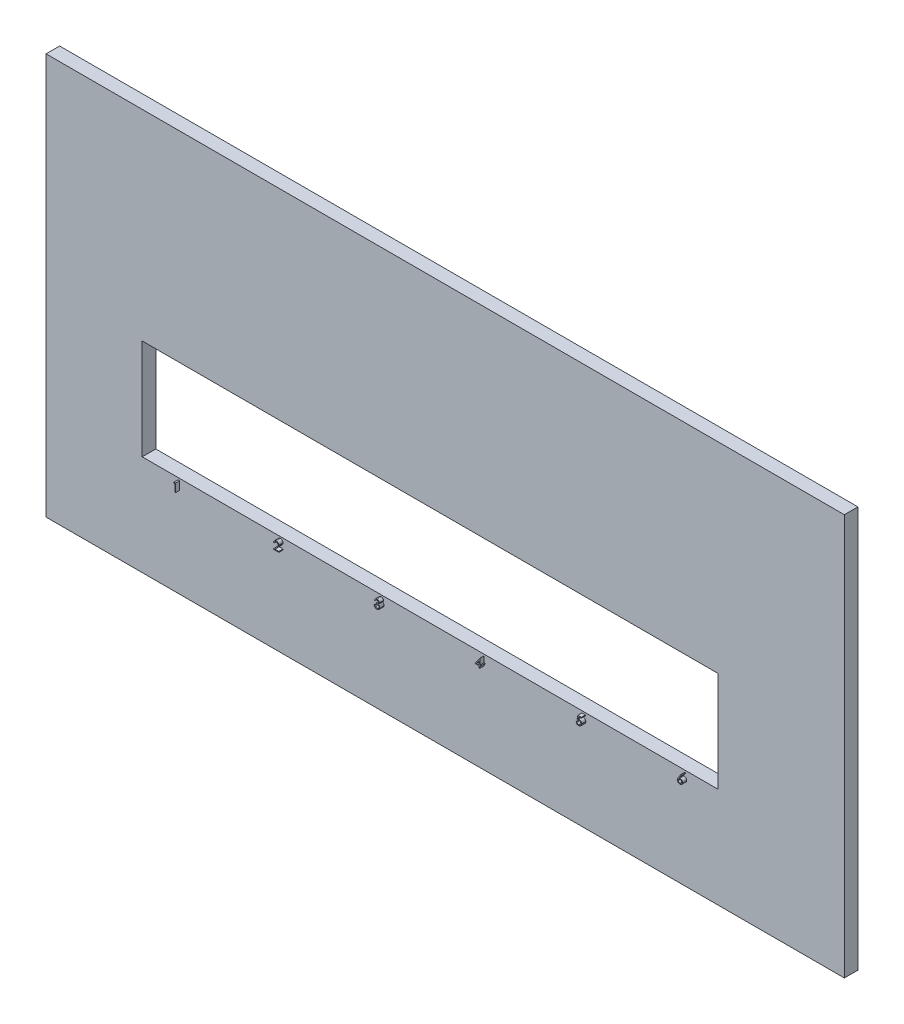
from build123d import *

# Parameters (mm, degrees)
SKETCH1_W           = 4851.4
SKETCH1_H           = 2438.4
BOSS_EXTRUDE1_DEPTH = 82.55
SKETCH2_W           = 3498.85
SKETCH2_H           = 609.6
CUT_EXTRUDE1_DEPTH  = 5431.349070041
BOSS_EXTRUDE2_DEPTH = 25.4


with BuildPart() as part:
    # Sketch1 → Boss-Extrude1 (new body)
    with BuildSketch(Plane.XY):
        with Locations((2425.7, 1219.2)):
            Rectangle(SKETCH1_W, SKETCH1_H)
    extrude(amount=BOSS_EXTRUDE1_DEPTH)

    # Sketch2 → Cut-Extrude1 (cut, through all)
    with BuildSketch(Plane.XY.offset(82.55)):
        with Locations((2333.625, 914.4)):
            Rectangle(SKETCH2_W, SKETCH2_H)
    extrude(amount=-CUT_EXTRUDE1_DEPTH, mode=Mode.SUBTRACT)

    # Sketch3 → Boss-Extrude2 (add)
    # profile 1 of 6: a face of its own
    with BuildSketch(Plane.XY.offset(82.55)):
        Polygon((802.851010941, 598.135093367), (812.243719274, 598.135093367), (812.243719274, 547.335093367), (807.684744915, 547.335093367), (807.684744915, 592.924836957), (799.8693603, 592.924836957), align=None)
    # profile 2 of 6: a face of its own
    with BuildSketch(Plane.XY.offset(82.55)):
        with BuildLine():
            Line((1412.074488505, 582.504324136), (1407.515514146, 582.504324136))
            add(Edge.make_bspline(
                [(1407.515514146, 582.504324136), (1407.54522711, 583.109147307), (1407.60358258, 584.297003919), (1407.87686175, 586.028905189), (1408.267889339, 587.684329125), (1408.820759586, 589.249983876), (1409.507376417, 590.739712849), (1410.330772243, 592.147598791), (1411.306042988, 593.468270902), (1412.412129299, 594.689486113), (1413.613456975, 595.809808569), (1414.909668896, 596.777261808), (1416.271762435, 597.594672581), (1417.69560514, 598.278023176), (1419.19726132, 598.790955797), (1420.763103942, 599.171544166), (1422.40001255, 599.400526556), (1423.515290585, 599.425139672), (1424.082501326, 599.437657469)],
                knots=[0, 0, 0, 0, 1.10065271, 2.161652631, 3.183658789, 4.190468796, 5.17591951, 6.163126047, 7.15150782, 8.156236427, 9.156009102, 10.134482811, 11.092018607, 12.041330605, 13.001268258, 13.972401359, 14.968799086, 16, 16, 16, 16], degree=3))
            add(Edge.make_bspline(
                [(1424.082501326, 599.437657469), (1424.639531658, 599.424617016), (1425.734076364, 599.398992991), (1427.331547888, 599.17894148), (1428.852315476, 598.834291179), (1430.293406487, 598.350741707), (1431.643323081, 597.700727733), (1432.912206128, 596.919894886), (1434.115161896, 596.016818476), (1435.19802607, 594.953591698), (1436.192371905, 593.818539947), (1437.050198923, 592.60677266), (1437.784812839, 591.35521617), (1438.397136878, 590.054326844), (1438.847894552, 588.691855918), (1439.1901154, 587.287639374), (1439.38355329, 585.827142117), (1439.413241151, 584.83862411), (1439.428334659, 584.336054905)],
                knots=[0, 0, 0, 0, 1.111607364, 2.184268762, 3.212621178, 4.221274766, 5.211760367, 6.196651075, 7.1921475, 8.207485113, 9.220403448, 10.201281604, 11.166441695, 12.114753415, 13.065576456, 14.026450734, 14.996634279, 16, 16, 16, 16], degree=3))
            add(Edge.make_bspline(
                [(1439.428334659, 584.336054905), (1439.403758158, 583.628514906), (1439.355036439, 582.225851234), (1438.938267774, 580.16460694), (1438.287352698, 578.167536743), (1437.503619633, 576.560263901), (1436.712991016, 575.265103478), (1436.000520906, 574.198757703), (1435.166460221, 573.050598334), (1434.19866945, 571.824470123), (1433.117168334, 570.510768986), (1431.912160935, 569.110288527), (1430.575054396, 567.637498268), (1429.636582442, 566.631576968), (1429.150289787, 566.110333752)],
                knots=[0, 0, 0, 0, 1.184426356, 2.348067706, 3.509069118, 4.696110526, 5.333549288, 6.050745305, 6.844228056, 7.710549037, 8.667450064, 9.695053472, 10.805634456, 12, 12, 12, 12], degree=3))
            Line((1429.150289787, 566.110333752), (1416.440113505, 552.545349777))
            Line((1416.440113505, 552.545349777), (1440.07961671, 552.545349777))
            Line((1440.07961671, 552.545349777), (1440.07961671, 547.335093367))
            Line((1440.07961671, 547.335093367), (1405.561667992, 547.335093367))
            Line((1405.561667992, 547.335093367), (1425.262950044, 568.359292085))
            add(Edge.make_bspline(
                [(1425.262950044, 568.359292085), (1425.742616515, 568.860010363), (1426.66395764, 569.8217877), (1427.967087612, 571.225942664), (1429.137504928, 572.528593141), (1430.182785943, 573.727277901), (1431.080255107, 574.839530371), (1431.876686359, 575.829327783), (1432.514815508, 576.740163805), (1433.207370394, 577.795941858), (1433.878133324, 579.084989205), (1434.454529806, 580.66027818), (1434.805991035, 582.281919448), (1434.848152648, 583.377777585), (1434.8693603, 583.929003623)],
                knots=[0, 0, 0, 0, 1.329631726, 2.553950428, 3.673215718, 4.687767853, 5.603093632, 6.413772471, 7.123043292, 7.734684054, 8.834405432, 9.900288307, 10.943827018, 12, 12, 12, 12], degree=3))
            add(Edge.make_bspline(
                [(1434.8693603, 583.929003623), (1434.860132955, 584.275625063), (1434.841947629, 584.95874936), (1434.681453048, 585.960318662), (1434.438911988, 586.926459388), (1434.091363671, 587.860143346), (1433.632614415, 588.751983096), (1433.074200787, 589.603064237), (1432.429910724, 590.425864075), (1431.684583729, 591.197346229), (1430.865810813, 591.903919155), (1430.000842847, 592.529834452), (1429.08571562, 593.052916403), (1428.124287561, 593.481719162), (1427.119239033, 593.818093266), (1426.068626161, 594.051172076), (1424.975351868, 594.197512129), (1424.228831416, 594.217312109), (1423.848446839, 594.227401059)],
                knots=[0, 0, 0, 0, 0.991446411, 1.95395049, 2.89581595, 3.838931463, 4.798493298, 5.75982156, 6.748411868, 7.785213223, 8.824556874, 9.840280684, 10.836137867, 11.835679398, 12.848801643, 13.863922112, 14.911575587, 16, 16, 16, 16], degree=3))
            add(Edge.make_bspline(
                [(1423.848446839, 594.227401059), (1423.451178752, 594.217022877), (1422.671009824, 594.19664184), (1421.525556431, 594.054072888), (1420.432837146, 593.808116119), (1419.39010324, 593.471723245), (1418.395590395, 593.044153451), (1417.454135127, 592.511598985), (1416.567850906, 591.876112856), (1415.735071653, 591.155615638), (1414.967788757, 590.353445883), (1414.29364553, 589.459221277), (1413.704597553, 588.489269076), (1413.190657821, 587.446206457), (1412.77328952, 586.320568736), (1412.454364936, 585.116351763), (1412.202007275, 583.838784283), (1412.117700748, 582.956532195), (1412.074488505, 582.504324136)],
                knots=[0, 0, 0, 0, 1.031018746, 2.02475058, 2.990194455, 3.934040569, 4.864654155, 5.795059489, 6.735614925, 7.690564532, 8.649604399, 9.611025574, 10.590972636, 11.591080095, 12.624614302, 13.701020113, 14.821632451, 16, 16, 16, 16], degree=3))
        make_face()
    # profile 3 of 6: a face of its own
    with BuildSketch(Plane.XY.offset(82.55)):
        with BuildLine():
            Line((2025.582180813, 586.412016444), (2021.023206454, 586.412016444))
            add(Edge.make_bspline(
                [(2021.023206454, 586.412016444), (2021.146716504, 586.923390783), (2021.388168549, 587.923085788), (2021.891779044, 589.351396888), (2022.440408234, 590.703018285), (2023.099198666, 591.952641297), (2023.81778287, 593.125379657), (2024.641072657, 594.194634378), (2025.53108463, 595.187599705), (2026.515515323, 596.068808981), (2027.54789704, 596.866771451), (2028.642776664, 597.547129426), (2029.778126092, 598.132405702), (2030.961811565, 598.614573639), (2032.197357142, 598.97780124), (2033.473592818, 599.241334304), (2034.793863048, 599.412473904), (2035.69008522, 599.429176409), (2036.145161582, 599.437657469)],
                knots=[0, 0, 0, 0, 1.162005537, 2.271625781, 3.343758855, 4.383309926, 5.390229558, 6.379919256, 7.361854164, 8.333198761, 9.295911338, 10.242430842, 11.177959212, 12.116337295, 13.062827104, 14.020064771, 14.994644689, 16, 16, 16, 16], degree=3))
            add(Edge.make_bspline(
                [(2036.145161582, 599.437657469), (2036.808213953, 599.417638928), (2038.119855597, 599.378038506), (2040.046816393, 599.016423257), (2041.905034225, 598.444195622), (2043.674169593, 597.653548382), (2045.317454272, 596.678372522), (2046.779568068, 595.517741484), (2048.040692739, 594.194048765), (2049.098702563, 592.731987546), (2049.927105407, 591.169444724), (2050.537959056, 589.561259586), (2050.909839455, 587.911246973), (2050.958034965, 586.797169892), (2050.982180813, 586.239019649)],
                knots=[0, 0, 0, 0, 1.083050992, 2.142477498, 3.193116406, 4.255571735, 5.30263384, 6.308962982, 7.297363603, 8.282367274, 9.249857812, 10.179914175, 11.08814088, 12, 12, 12, 12], degree=3))
            add(Edge.make_bspline(
                [(2050.982180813, 586.239019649), (2050.96529212, 585.701892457), (2050.932243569, 584.650817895), (2050.651628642, 583.11634588), (2050.179388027, 581.670119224), (2049.525232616, 580.306049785), (2048.678446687, 579.032786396), (2047.652682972, 577.847464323), (2046.440701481, 576.744826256), (2045.522252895, 576.113172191), (2045.049408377, 575.787977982)],
                knots=[0, 0, 0, 0, 1.024540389, 2.004866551, 2.965041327, 3.920577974, 4.882998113, 5.874504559, 6.905732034, 8, 8, 8, 8], degree=3))
            add(Edge.make_bspline(
                [(2045.049408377, 575.787977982), (2045.589800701, 575.527037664), (2046.66047419, 575.010039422), (2048.119893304, 573.996132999), (2049.444726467, 572.825463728), (2050.183557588, 571.91189608), (2050.554776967, 571.452881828)],
                knots=[0, 0, 0, 0, 1.015518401, 2.012035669, 3.001164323, 4, 4, 4, 4], degree=3))
            add(Edge.make_bspline(
                [(2050.554776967, 571.452881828), (2050.799217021, 571.118215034), (2051.284094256, 570.454361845), (2051.882598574, 569.387033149), (2052.425565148, 568.30787439), (2052.84865976, 567.187960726), (2053.176303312, 566.040272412), (2053.410506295, 564.862838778), (2053.555999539, 563.654698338), (2053.576835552, 562.837362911), (2053.587309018, 562.426519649)],
                knots=[0, 0, 0, 0, 1.025084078, 2.033381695, 3.024893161, 4.013698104, 4.991890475, 5.976764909, 6.982997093, 8, 8, 8, 8], degree=3))
            add(Edge.make_bspline(
                [(2053.587309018, 562.426519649), (2053.561262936, 561.715178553), (2053.509293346, 560.295843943), (2053.044777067, 558.198896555), (2052.324676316, 556.149109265), (2051.302044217, 554.188594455), (2050.05573866, 552.354273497), (2048.57299807, 550.71305164), (2046.870669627, 549.302283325), (2044.972119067, 548.123574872), (2042.915196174, 547.181337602), (2040.715184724, 546.527361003), (2038.403783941, 546.101424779), (2036.818718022, 546.055750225), (2036.012869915, 546.032529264)],
                knots=[0, 0, 0, 0, 0.955779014, 1.907060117, 2.875433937, 3.871313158, 4.872415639, 5.851225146, 6.836215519, 7.83643374, 8.849228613, 9.86973379, 10.916971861, 12, 12, 12, 12], degree=3))
            add(Edge.make_bspline(
                [(2036.012869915, 546.032529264), (2035.4697555, 546.04513076), (2034.401087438, 546.0699263), (2032.830010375, 546.239432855), (2031.33036971, 546.549022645), (2029.900137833, 546.96563062), (2028.538044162, 547.493830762), (2027.24824515, 548.151599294), (2026.022805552, 548.925377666), (2024.873289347, 549.824299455), (2023.799833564, 550.829868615), (2022.830965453, 551.959936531), (2021.950531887, 553.193613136), (2021.182107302, 554.545227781), (2020.490690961, 555.997313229), (2019.922007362, 557.568462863), (2019.421473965, 559.244630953), (2019.188759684, 560.412707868), (2019.0693603, 561.012016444)],
                knots=[0, 0, 0, 0, 1.048658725, 2.063410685, 3.046034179, 4.001477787, 4.936774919, 5.862367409, 6.792675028, 7.730719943, 8.675894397, 9.627829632, 10.600096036, 11.597688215, 12.626045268, 13.701542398, 14.82072376, 16, 16, 16, 16], degree=3))
            Line((2019.0693603, 561.012016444), (2023.628334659, 561.012016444))
            add(Edge.make_bspline(
                [(2023.628334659, 561.012016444), (2023.747109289, 560.620870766), (2023.978136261, 559.860058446), (2024.371390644, 558.765096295), (2024.819421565, 557.761316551), (2025.30005573, 556.841355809), (2025.804840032, 555.996154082), (2026.369662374, 555.248060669), (2026.952688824, 554.564217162), (2027.39217201, 554.17894108), (2027.607260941, 553.990381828)],
                knots=[0, 0, 0, 0, 1.198163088, 2.33053128, 3.407730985, 4.417276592, 5.372219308, 6.28897303, 7.162600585, 8, 8, 8, 8], degree=3))
            add(Edge.make_bspline(
                [(2027.607260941, 553.990381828), (2027.891691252, 553.771095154), (2028.459673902, 553.333198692), (2029.385224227, 552.774375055), (2030.358623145, 552.290163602), (2031.400961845, 551.920285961), (2032.489747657, 551.607101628), (2033.642579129, 551.402152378), (2034.84928548, 551.261535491), (2035.673229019, 551.249126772), (2036.094280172, 551.242785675)],
                knots=[0, 0, 0, 0, 0.946170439, 1.889420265, 2.845303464, 3.807233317, 4.801018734, 5.828864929, 6.890507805, 8, 8, 8, 8], degree=3))
            add(Edge.make_bspline(
                [(2036.094280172, 551.242785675), (2036.569673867, 551.251725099), (2037.4992652, 551.269205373), (2038.85569573, 551.429961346), (2040.146123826, 551.664082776), (2041.356222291, 552.025676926), (2042.501842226, 552.472438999), (2043.566924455, 553.033392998), (2044.565450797, 553.691539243), (2045.484631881, 554.439593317), (2046.311155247, 555.258511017), (2047.038894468, 556.115043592), (2047.657560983, 557.005579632), (2048.156614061, 557.935047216), (2048.550684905, 558.899597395), (2048.818955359, 559.901936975), (2049.005485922, 560.93386301), (2049.02067675, 561.635323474), (2049.028334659, 561.988939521)],
                knots=[0, 0, 0, 0, 1.217147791, 2.380027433, 3.494444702, 4.572153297, 5.609568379, 6.639424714, 7.649109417, 8.668170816, 9.669597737, 10.625200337, 11.543417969, 12.441394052, 13.322311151, 14.205496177, 15.095365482, 16, 16, 16, 16], degree=3))
            add(Edge.make_bspline(
                [(2049.028334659, 561.988939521), (2049.006123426, 562.462269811), (2048.961811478, 563.406575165), (2048.623504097, 564.795847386), (2048.067042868, 566.134404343), (2047.288024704, 567.399408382), (2046.339723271, 568.571812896), (2045.231341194, 569.617878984), (2043.953674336, 570.481044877), (2042.777728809, 571.077417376), (2041.736108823, 571.484355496), (2040.844708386, 571.755409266), (2039.8467554, 571.984933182), (2038.754318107, 572.198471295), (2037.559165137, 572.380209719), (2036.262597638, 572.531765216), (2034.864352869, 572.653032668), (2033.896378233, 572.707186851), (2033.397565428, 572.735093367)],
                knots=[0, 0, 0, 0, 1.07054697, 2.135767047, 3.216561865, 4.33974944, 5.486079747, 6.621378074, 7.775625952, 8.963672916, 9.598146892, 10.304877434, 11.070270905, 11.915000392, 12.823868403, 13.805723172, 14.86925407, 16, 16, 16, 16], degree=3))
            Line((2033.397565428, 572.735093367), (2033.397565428, 577.945349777))
            add(Edge.make_bspline(
                [(2033.397565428, 577.945349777), (2034.026050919, 577.956014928), (2035.257099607, 577.976905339), (2037.055336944, 578.229570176), (2038.774892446, 578.579083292), (2040.37765773, 579.114445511), (2041.838501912, 579.73624182), (2043.105883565, 580.459811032), (2044.162046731, 581.264116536), (2045.001858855, 582.161572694), (2045.633654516, 583.12408824), (2046.095597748, 584.127267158), (2046.368471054, 585.179902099), (2046.404897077, 585.898281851), (2046.423206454, 586.259372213)],
                knots=[0, 0, 0, 0, 1.321986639, 2.589447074, 3.816329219, 5.01088745, 6.139805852, 7.153945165, 8.075214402, 8.924034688, 9.728124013, 10.488707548, 11.240355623, 12, 12, 12, 12], degree=3))
            add(Edge.make_bspline(
                [(2046.423206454, 586.259372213), (2046.417191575, 586.524660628), (2046.405225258, 587.052439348), (2046.254316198, 587.823511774), (2046.027544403, 588.571011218), (2045.715781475, 589.291758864), (2045.298492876, 589.980755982), (2044.799114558, 590.643876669), (2044.204491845, 591.277334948), (2043.523112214, 591.867780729), (2042.791420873, 592.430488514), (2041.989509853, 592.908206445), (2041.141558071, 593.316711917), (2040.246626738, 593.653581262), (2039.301811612, 593.906990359), (2038.311551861, 594.088939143), (2037.273959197, 594.202697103), (2036.566072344, 594.219075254), (2036.206219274, 594.227401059)],
                knots=[0, 0, 0, 0, 0.884392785, 1.759457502, 2.611959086, 3.489218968, 4.37281399, 5.2945488, 6.255912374, 7.266815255, 8.301784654, 9.332968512, 10.37626691, 11.440494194, 12.520033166, 13.637162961, 14.798855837, 16, 16, 16, 16], degree=3))
            add(Edge.make_bspline(
                [(2036.206219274, 594.227401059), (2035.627800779, 594.207206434), (2034.498014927, 594.167761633), (2032.869295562, 593.822277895), (2031.355174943, 593.27105314), (2030.197825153, 592.613076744), (2029.343186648, 591.963556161), (2028.732469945, 591.396303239), (2028.132732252, 590.765906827), (2027.583429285, 590.033539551), (2027.027909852, 589.248798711), (2026.52216593, 588.371792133), (2026.030716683, 587.425396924), (2025.734588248, 586.756351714), (2025.582180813, 586.412016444)],
                knots=[0, 0, 0, 0, 1.472543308, 2.876219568, 4.221790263, 5.565193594, 6.249813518, 6.953379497, 7.687249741, 8.463570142, 9.283606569, 10.136032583, 11.040678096, 12, 12, 12, 12], degree=3))
        make_face()
    # profile 4 of 6: a face of its own
    with BuildSketch(Plane.XY.offset(82.55)):
        Polygon((2660.307421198, 599.437657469), (2661.233462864, 599.437657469), (2661.233462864, 564.2684267), (2667.095001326, 564.2684267), (2667.095001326, 559.05817029), (2661.233462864, 559.05817029), (2661.233462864, 547.335093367), (2656.674488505, 547.335093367), (2656.674488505, 559.05817029), (2632.577052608, 559.05817029), align=None)
        Polygon((2656.674488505, 564.2684267), (2656.674488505, 586.330606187), (2641.532180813, 564.2684267), align=None, mode=Mode.SUBTRACT)
    # profile 5 of 6: a face of its own
    with BuildSketch(Plane.XY.offset(82.55)):
        with BuildLine():
            Line((3277.997565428, 598.135093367), (3277.997565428, 592.924836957))
            Line((3277.997565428, 592.924836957), (3260.718238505, 592.924836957))
            Line((3260.718238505, 592.924836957), (3257.980818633, 579.563378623))
            add(Edge.make_bspline(
                [(3257.980818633, 579.563378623), (3258.518658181, 579.711863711), (3259.560637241, 579.999530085), (3261.098568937, 580.318928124), (3262.558592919, 580.511466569), (3263.506018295, 580.537756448), (3263.96447248, 580.550477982)],
                knots=[0, 0, 0, 0, 1.100273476, 2.13160584, 3.095893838, 4, 4, 4, 4], degree=3))
            add(Edge.make_bspline(
                [(3263.96447248, 580.550477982), (3264.531745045, 580.53819983), (3265.64714464, 580.514057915), (3267.279115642, 580.282237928), (3268.836975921, 579.917350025), (3270.317467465, 579.407600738), (3271.723329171, 578.755768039), (3273.04162635, 577.941517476), (3274.292146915, 576.990347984), (3275.452456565, 575.896768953), (3276.505095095, 574.693220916), (3277.430612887, 573.399158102), (3278.216744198, 572.027156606), (3278.84899744, 570.56410777), (3279.353867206, 569.026186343), (3279.689901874, 567.397210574), (3279.913664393, 565.692535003), (3279.9386636, 564.526971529), (3279.951411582, 563.932609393)],
                knots=[0, 0, 0, 0, 1.052922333, 2.070308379, 3.05430497, 4.020497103, 4.973039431, 5.925935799, 6.892292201, 7.88610001, 8.88166317, 9.857072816, 10.836096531, 11.812156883, 12.81219415, 13.836441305, 14.89672472, 16, 16, 16, 16], degree=3))
            add(Edge.make_bspline(
                [(3279.951411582, 563.932609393), (3279.94175849, 563.518629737), (3279.922582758, 562.696265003), (3279.825067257, 561.474972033), (3279.637314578, 560.279534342), (3279.385234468, 559.10979334), (3279.058047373, 557.967963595), (3278.661966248, 556.850776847), (3278.177246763, 555.765186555), (3277.645568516, 554.700920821), (3277.04690535, 553.682039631), (3276.382463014, 552.729191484), (3275.680472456, 551.828082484), (3274.925128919, 550.988376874), (3274.109411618, 550.2155925), (3273.243199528, 549.505143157), (3272.333404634, 548.845014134), (3271.365951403, 548.262001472), (3270.36239765, 547.725510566), (3269.308250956, 547.285386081), (3268.227507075, 546.891896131), (3267.104611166, 546.578249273), (3265.942106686, 546.332485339), (3264.738077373, 546.165562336), (3263.498837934, 546.043984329), (3262.658823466, 546.036373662), (3262.234504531, 546.032529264)],
                knots=[0, 0, 0, 0, 1.056347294, 2.098418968, 3.122841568, 4.141288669, 5.149314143, 6.15115421, 7.162517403, 8.180376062, 9.185164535, 10.17417709, 11.141909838, 12.097768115, 13.052685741, 14.0056014, 14.954263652, 15.917497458, 16.885230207, 17.854509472, 18.828990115, 19.81800267, 20.826176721, 21.857883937, 22.917946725, 24, 24, 24, 24], degree=3))
            add(Edge.make_bspline(
                [(3262.234504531, 546.032529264), (3261.728330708, 546.042556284), (3260.732493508, 546.062283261), (3259.273509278, 546.268654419), (3257.869765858, 546.564222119), (3256.532563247, 547.008885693), (3255.249917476, 547.566049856), (3254.039096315, 548.270227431), (3252.869161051, 549.068209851), (3251.787672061, 550.009901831), (3250.783920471, 551.039192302), (3249.885391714, 552.156177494), (3249.085167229, 553.342421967), (3248.396061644, 554.603686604), (3247.808261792, 555.936657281), (3247.346489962, 557.346328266), (3246.973786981, 558.825334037), (3246.816112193, 559.843562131), (3246.736026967, 560.360734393)],
                knots=[0, 0, 0, 0, 1.0467383, 2.05933395, 3.04377827, 4.011590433, 4.970194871, 5.932262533, 6.905835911, 7.896367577, 8.894135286, 9.877477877, 10.858688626, 11.851381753, 12.8477658, 13.868841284, 14.917554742, 16, 16, 16, 16], degree=3))
            Line((3246.736026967, 560.360734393), (3251.295001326, 560.360734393))
            add(Edge.make_bspline(
                [(3251.295001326, 560.360734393), (3251.407175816, 559.876299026), (3251.622781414, 558.945187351), (3252.096030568, 557.636995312), (3252.674655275, 556.471219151), (3253.362695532, 555.432437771), (3254.183478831, 554.526615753), (3255.1200774, 553.719373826), (3256.170152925, 552.991117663), (3257.337003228, 552.38409007), (3258.568004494, 551.866383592), (3259.856397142, 551.521644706), (3261.167100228, 551.279243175), (3262.053609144, 551.254978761), (3262.499087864, 551.242785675)],
                knots=[0, 0, 0, 0, 1.136247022, 2.183929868, 3.172523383, 4.106158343, 5.02341133, 5.958108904, 6.928429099, 7.938127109, 8.96079061, 9.975095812, 10.982467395, 12, 12, 12, 12], degree=3))
            add(Edge.make_bspline(
                [(3262.499087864, 551.242785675), (3262.933913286, 551.25469868), (3263.7900881, 551.278155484), (3265.050093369, 551.458698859), (3266.266577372, 551.736757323), (3267.427536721, 552.15287979), (3268.553287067, 552.658625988), (3269.615352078, 553.307633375), (3270.644456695, 554.054538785), (3271.608613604, 554.910252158), (3272.491654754, 555.853240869), (3273.271886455, 556.861655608), (3273.92179137, 557.937408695), (3274.469475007, 559.06187617), (3274.885357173, 560.247382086), (3275.182043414, 561.488370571), (3275.35625924, 562.787906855), (3275.380224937, 563.674284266), (3275.392437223, 564.125958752)],
                knots=[0, 0, 0, 0, 1.027316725, 2.022795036, 3.002884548, 3.971462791, 4.93288096, 5.914575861, 6.907176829, 7.935150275, 8.956128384, 9.956726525, 10.942570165, 11.921478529, 12.907843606, 13.90538589, 14.932640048, 16, 16, 16, 16], degree=3))
            add(Edge.make_bspline(
                [(3275.392437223, 564.125958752), (3275.382879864, 564.533458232), (3275.364172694, 565.331080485), (3275.211328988, 566.498017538), (3274.945471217, 567.602163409), (3274.57646176, 568.648850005), (3274.107947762, 569.63906454), (3273.535412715, 570.573828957), (3272.848111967, 571.440822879), (3272.063006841, 572.240451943), (3271.202918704, 572.978428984), (3270.253049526, 573.607537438), (3269.233276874, 574.136785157), (3268.155887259, 574.593520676), (3266.995253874, 574.921554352), (3265.774361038, 575.16783109), (3264.48002482, 575.310294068), (3263.595078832, 575.330060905), (3263.140193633, 575.340221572)],
                knots=[0, 0, 0, 0, 1.045622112, 2.046656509, 3.013763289, 3.955457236, 4.890082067, 5.820317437, 6.762574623, 7.722996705, 8.69280354, 9.665887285, 10.63943826, 11.638615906, 12.663482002, 13.728887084, 14.832589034, 16, 16, 16, 16], degree=3))
            add(Edge.make_bspline(
                [(3263.140193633, 575.340221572), (3262.74643661, 575.331794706), (3261.933428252, 575.314395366), (3260.686319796, 575.186285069), (3259.375799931, 574.979611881), (3258.006892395, 574.695331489), (3256.575486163, 574.323314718), (3255.084601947, 573.877515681), (3253.531105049, 573.344522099), (3252.484367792, 572.942008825), (3251.946283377, 572.735093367)],
                knots=[0, 0, 0, 0, 0.817624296, 1.688186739, 2.600797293, 3.572016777, 4.590301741, 5.671205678, 6.80286297, 8, 8, 8, 8], degree=3))
            Line((3251.946283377, 572.735093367), (3257.156539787, 598.135093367))
            Line((3257.156539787, 598.135093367), (3277.997565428, 598.135093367))
        make_face()
    # profile 6 of 6: a face of its own
    with BuildSketch(Plane.XY.offset(82.55)):
        with BuildLine():
            Line((3883.038591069, 599.437657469), (3886.549408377, 596.679885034))
            Line((3886.549408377, 596.679885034), (3873.126892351, 576.154324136))
            add(Edge.make_bspline(
                [(3873.126892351, 576.154324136), (3874.020540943, 576.296765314), (3875.763703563, 576.574612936), (3877.528145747, 576.620448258), (3878.388030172, 576.642785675)],
                knots=[0, 0, 0, 0, 1.025318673, 2, 2, 2, 2], degree=3))
            add(Edge.make_bspline(
                [(3878.388030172, 576.642785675), (3878.904339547, 576.628908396), (3879.920679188, 576.601591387), (3881.412846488, 576.39136864), (3882.84669733, 576.060078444), (3884.216288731, 575.577155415), (3885.526536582, 574.9602641), (3886.784959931, 574.220922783), (3887.967903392, 573.320954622), (3889.090600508, 572.315623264), (3890.109896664, 571.202131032), (3891.012337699, 570.020648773), (3891.770372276, 568.772407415), (3892.385399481, 567.458039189), (3892.862990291, 566.079570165), (3893.211153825, 564.638764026), (3893.416960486, 563.13462724), (3893.444907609, 562.111686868), (3893.45910389, 561.592064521)],
                knots=[0, 0, 0, 0, 1.04369286, 2.054478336, 3.041073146, 4.015093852, 4.984733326, 5.965804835, 6.960378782, 7.985147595, 9.009457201, 10.008161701, 10.986880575, 11.956520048, 12.937015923, 13.931873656, 14.949455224, 16, 16, 16, 16], degree=3))
            add(Edge.make_bspline(
                [(3893.45910389, 561.592064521), (3893.438448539, 560.881159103), (3893.397803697, 559.482265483), (3892.992800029, 557.444797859), (3892.363465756, 555.503765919), (3891.463906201, 553.690159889), (3890.3465619, 552.006465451), (3888.983995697, 550.514607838), (3887.42453021, 549.184082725), (3885.66123611, 548.071466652), (3883.763595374, 547.162828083), (3881.77002924, 546.510189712), (3879.699898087, 546.108383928), (3878.294848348, 546.058010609), (3877.58410389, 546.032529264)],
                knots=[0, 0, 0, 0, 1.031375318, 2.029502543, 3.004789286, 3.987476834, 4.960371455, 5.9300674, 6.912260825, 7.929083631, 8.949397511, 9.960523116, 10.96833055, 12, 12, 12, 12], degree=3))
            add(Edge.make_bspline(
                [(3877.58410389, 546.032529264), (3876.90052892, 546.054710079), (3875.54648659, 546.09864639), (3873.554650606, 546.490037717), (3871.640753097, 547.124415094), (3869.818203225, 547.998382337), (3868.129892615, 549.102308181), (3866.619454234, 550.431269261), (3865.294419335, 551.956858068), (3864.19170198, 553.678837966), (3863.317089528, 555.529263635), (3862.661190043, 557.458751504), (3862.278067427, 559.460271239), (3862.224530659, 560.817083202), (3862.197565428, 561.500477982)],
                knots=[0, 0, 0, 0, 1.012016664, 2.004627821, 2.994792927, 3.992885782, 4.990978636, 5.973936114, 6.964471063, 7.975201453, 8.993600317, 9.990122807, 10.98767138, 12, 12, 12, 12], degree=3))
            add(Edge.make_bspline(
                [(3862.197565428, 561.500477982), (3862.214713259, 562.023639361), (3862.249725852, 563.091834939), (3862.494195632, 564.709655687), (3862.887021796, 566.365025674), (3863.326953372, 567.769343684), (3863.791782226, 568.919768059), (3864.178624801, 569.84728158), (3864.660121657, 570.801756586), (3865.173541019, 571.815922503), (3865.765097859, 572.863642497), (3866.408307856, 573.962427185), (3867.120954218, 575.094801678), (3867.620538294, 575.863248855), (3867.875930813, 576.256086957)],
                knots=[0, 0, 0, 0, 1.173818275, 2.396712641, 3.66331629, 4.989737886, 5.693666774, 6.447286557, 7.243889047, 8.091586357, 8.998013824, 9.943181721, 10.948533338, 12, 12, 12, 12], degree=3))
            Line((3867.875930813, 576.256086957), (3883.038591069, 599.437657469))
        make_face()
        with BuildLine():
            add(Edge.make_bspline(
                [(3877.431459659, 571.432529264), (3877.04447622, 571.421236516), (3876.288585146, 571.399178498), (3875.179586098, 571.27108627), (3874.130010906, 571.029872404), (3873.125954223, 570.722658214), (3872.186187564, 570.300248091), (3871.303880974, 569.78714198), (3870.475622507, 569.183040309), (3869.710087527, 568.49650137), (3869.016019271, 567.744835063), (3868.418304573, 566.93973457), (3867.902722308, 566.100602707), (3867.483523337, 565.220428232), (3867.157095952, 564.299547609), (3866.92097391, 563.342196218), (3866.789565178, 562.34195429), (3866.767703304, 561.663665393), (3866.756539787, 561.317304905)],
                knots=[0, 0, 0, 0, 1.129588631, 2.206414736, 3.251139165, 4.268635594, 5.265702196, 6.250456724, 7.242448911, 8.251968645, 9.246821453, 10.222880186, 11.173611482, 12.116736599, 13.062300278, 14.020270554, 14.989073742, 16, 16, 16, 16], degree=3))
            add(Edge.make_bspline(
                [(3866.756539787, 561.317304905), (3866.765630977, 560.97404234), (3866.783457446, 560.300955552), (3866.945325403, 559.309061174), (3867.192577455, 558.354530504), (3867.560375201, 557.442284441), (3867.999096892, 556.558417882), (3868.578294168, 555.734945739), (3869.220069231, 554.921854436), (3869.987206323, 554.181604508), (3870.810505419, 553.492805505), (3871.690088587, 552.890749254), (3872.60681029, 552.375692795), (3873.573046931, 551.972034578), (3874.575089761, 551.640756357), (3875.621287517, 551.407635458), (3876.71236782, 551.27583811), (3877.451463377, 551.253947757), (3877.828334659, 551.242785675)],
                knots=[0, 0, 0, 0, 0.989467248, 1.94019797, 2.891935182, 3.827694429, 4.772920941, 5.730924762, 6.725747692, 7.756678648, 8.79901574, 9.819492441, 10.826891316, 11.826466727, 12.835195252, 13.867842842, 14.912794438, 16, 16, 16, 16], degree=3))
            add(Edge.make_bspline(
                [(3877.828334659, 551.242785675), (3878.205205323, 551.253948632), (3878.94429967, 551.275840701), (3880.03538875, 551.407625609), (3881.08155406, 551.640792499), (3882.083714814, 551.971903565), (3883.049516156, 552.376178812), (3883.965436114, 552.887544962), (3884.836701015, 553.496508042), (3885.660540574, 554.1804274), (3886.424484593, 554.926067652), (3887.081651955, 555.727687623), (3887.643111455, 556.565073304), (3888.099356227, 557.438802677), (3888.463102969, 558.355082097), (3888.711608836, 559.308913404), (3888.873142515, 560.300994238), (3888.891014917, 560.974055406), (3888.900129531, 561.317304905)],
                knots=[0, 0, 0, 0, 1.087397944, 2.132534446, 3.165364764, 4.174271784, 5.174024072, 6.181601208, 7.194203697, 8.236725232, 9.267838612, 10.269026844, 11.221737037, 12.171628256, 13.107553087, 14.05945871, 15.010357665, 16, 16, 16, 16], degree=3))
            add(Edge.make_bspline(
                [(3888.900129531, 561.317304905), (3888.892142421, 561.664117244), (3888.876466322, 562.344797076), (3888.699160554, 563.341748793), (3888.453254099, 564.304411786), (3888.081934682, 565.226735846), (3887.599529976, 566.105081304), (3887.011942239, 566.943885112), (3886.332200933, 567.749578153), (3885.547013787, 568.497975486), (3884.692264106, 569.182281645), (3883.783443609, 569.786359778), (3882.832642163, 570.296173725), (3881.840823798, 570.721545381), (3880.796624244, 571.028514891), (3879.716901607, 571.270224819), (3878.587846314, 571.398850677), (3877.821831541, 571.421160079), (3877.431459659, 571.432529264)],
                knots=[0, 0, 0, 0, 0.978206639, 1.919901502, 2.851605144, 3.780102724, 4.718870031, 5.675451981, 6.667674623, 7.690630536, 8.733308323, 9.756129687, 10.767539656, 11.776269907, 12.797430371, 13.836405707, 14.897401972, 16, 16, 16, 16], degree=3))
        make_face(mode=Mode.SUBTRACT)
    extrude(amount=BOSS_EXTRUDE2_DEPTH)


solid = part.part
